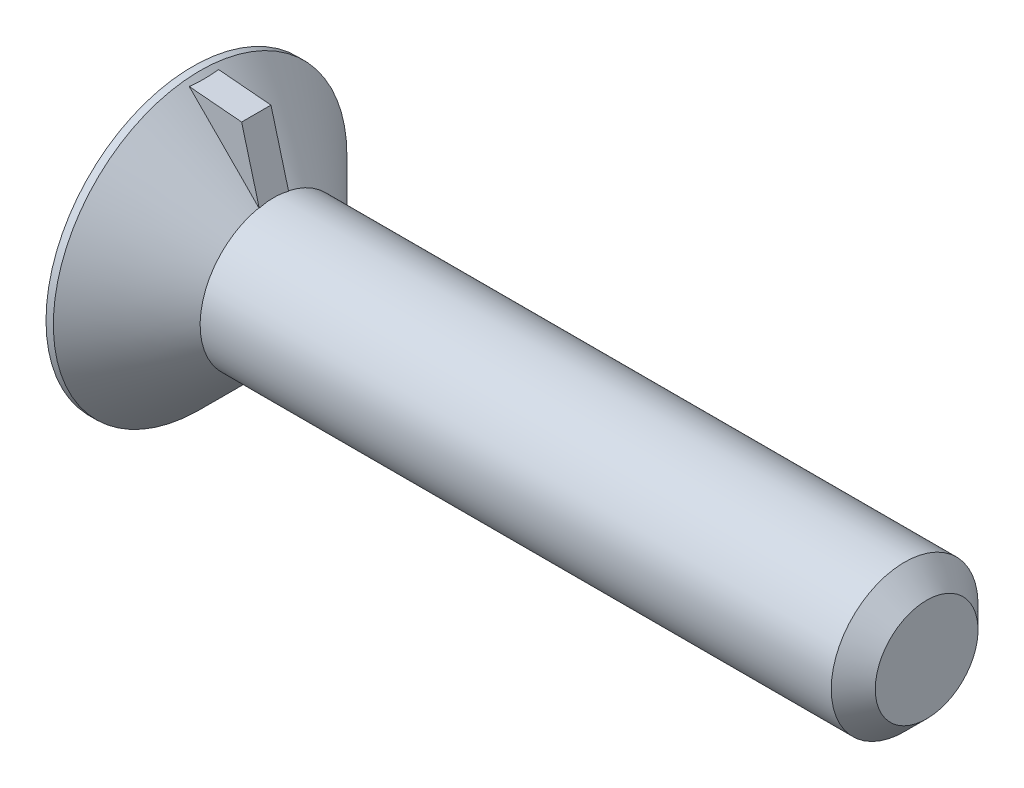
ISO-10303-21;
HEADER;
FILE_DESCRIPTION(('STEP AP214'),'2;1');
FILE_NAME('part.step','',(''),(''),'','','');
FILE_SCHEMA(('AUTOMOTIVE_DESIGN { 1 0 10303 214 1 1 1 1 }'));
ENDSEC;
DATA;
#1=APPLICATION_CONTEXT('core data for automotive mechanical design processes');
#2=APPLICATION_PROTOCOL_DEFINITION('international standard','automotive_design',2000,#1);
#3=PRODUCT_CONTEXT('',#1,'mechanical');
#4=PRODUCT('Part','Part','',(#3));
#5=PRODUCT_RELATED_PRODUCT_CATEGORY('part','',(#4));
#6=PRODUCT_DEFINITION_FORMATION('','',#4);
#7=PRODUCT_DEFINITION_CONTEXT('part definition',#1,'design');
#8=PRODUCT_DEFINITION('design','',#6,#7);
#9=PRODUCT_DEFINITION_SHAPE('','',#8);
#10=(LENGTH_UNIT() NAMED_UNIT(*) SI_UNIT(.MILLI.,.METRE.));
#11=(NAMED_UNIT(*) PLANE_ANGLE_UNIT() SI_UNIT($,.RADIAN.));
#12=(NAMED_UNIT(*) SI_UNIT($,.STERADIAN.) SOLID_ANGLE_UNIT());
#13=UNCERTAINTY_MEASURE_WITH_UNIT(LENGTH_MEASURE(1.E-05),#10,'distance_accuracy_value','');
#14=(GEOMETRIC_REPRESENTATION_CONTEXT(3) GLOBAL_UNCERTAINTY_ASSIGNED_CONTEXT((#13)) GLOBAL_UNIT_ASSIGNED_CONTEXT((#10,
#11,#12)) REPRESENTATION_CONTEXT('',''));
#15=CARTESIAN_POINT('',(0.,0.,0.));
#16=DIRECTION('',(0.,0.,1.));
#17=DIRECTION('',(1.,0.,0.));
#18=AXIS2_PLACEMENT_3D('',#15,#16,#17);
#19=CARTESIAN_POINT('',(50.,0.,0.));
#20=DIRECTION('',(1.,0.,0.));
#21=DIRECTION('',(0.,0.,-1.));
#22=AXIS2_PLACEMENT_3D('',#19,#20,#21);
#23=CYLINDRICAL_SURFACE('',#22,5.);
#24=DIRECTION('',(1.,0.,0.));
#25=VECTOR('',#24,1.);
#26=CARTESIAN_POINT('',(50.,4.89897948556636,1.));
#27=LINE('',#26,#25);
#28=CARTESIAN_POINT('',(5.5,4.89897948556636,1.));
#29=VERTEX_POINT('',#28);
#30=CARTESIAN_POINT('',(5.52706836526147,4.89897948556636,1.));
#31=VERTEX_POINT('',#30);
#32=EDGE_CURVE('E85',#29,#31,#27,.T.);
#33=ORIENTED_EDGE('',*,*,#32,.F.);
#34=CARTESIAN_POINT('',(5.5,0.,0.));
#35=DIRECTION('',(1.,0.,0.));
#36=DIRECTION('',(0.,0.,-1.));
#37=AXIS2_PLACEMENT_3D('',#34,#35,#36);
#38=CIRCLE('',#37,5.);
#39=CARTESIAN_POINT('',(5.5,4.89897948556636,-1.));
#40=VERTEX_POINT('',#39);
#41=EDGE_CURVE('E113',#29,#40,#38,.T.);
#42=ORIENTED_EDGE('',*,*,#41,.T.);
#43=DIRECTION('',(1.,0.,0.));
#44=VECTOR('',#43,1.);
#45=CARTESIAN_POINT('',(50.,4.89897948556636,-1.));
#46=LINE('',#45,#44);
#47=CARTESIAN_POINT('',(5.52706836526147,4.89897948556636,-1.));
#48=VERTEX_POINT('',#47);
#49=EDGE_CURVE('E55',#40,#48,#46,.T.);
#50=ORIENTED_EDGE('',*,*,#49,.T.);
#51=CARTESIAN_POINT('',(6.83974596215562,0.,0.));
#52=DIRECTION('',(-0.965925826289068,-0.258819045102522,0.));
#53=DIRECTION('',(0.258819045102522,-0.965925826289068,0.));
#54=AXIS2_PLACEMENT_3D('',#51,#52,#53);
#55=ELLIPSE('',#54,5.17638090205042,5.);
#56=EDGE_CURVE('E105',#48,#31,#55,.F.);
#57=ORIENTED_EDGE('',*,*,#56,.T.);
#58=EDGE_LOOP('',(#33,#42,#50,#57));
#59=FACE_BOUND('',#58,.T.);
#60=CARTESIAN_POINT('',(48.5,0.,0.));
#61=DIRECTION('',(-1.,0.,0.));
#62=DIRECTION('',(0.,0.,1.));
#63=AXIS2_PLACEMENT_3D('',#60,#61,#62);
#64=CIRCLE('',#63,5.);
#65=CARTESIAN_POINT('',(48.5,0.,5.));
#66=VERTEX_POINT('',#65);
#67=EDGE_CURVE('E110',#66,#66,#64,.T.);
#68=ORIENTED_EDGE('',*,*,#67,.T.);
#69=EDGE_LOOP('',(#68));
#70=FACE_BOUND('',#69,.T.);
#71=ADVANCED_FACE('F34',(#59,#70),#23,.T.);
#72=CARTESIAN_POINT('',(0.,0.,0.));
#73=DIRECTION('',(-1.,0.,0.));
#74=DIRECTION('',(0.,0.,1.));
#75=AXIS2_PLACEMENT_3D('',#72,#73,#74);
#76=PLANE('',#75);
#77=CARTESIAN_POINT('',(0.,0.,0.));
#78=DIRECTION('',(1.,0.,0.));
#79=DIRECTION('',(0.,0.,-1.));
#80=AXIS2_PLACEMENT_3D('',#77,#78,#79);
#81=CIRCLE('',#80,10.);
#82=CARTESIAN_POINT('',(0.,0.,-10.));
#83=VERTEX_POINT('',#82);
#84=EDGE_CURVE('E119',#83,#83,#81,.T.);
#85=ORIENTED_EDGE('',*,*,#84,.F.);
#86=EDGE_LOOP('',(#85));
#87=FACE_BOUND('',#86,.T.);
#88=ADVANCED_FACE('F36',(#87),#76,.T.);
#89=CARTESIAN_POINT('',(50.,0.,0.));
#90=DIRECTION('',(1.,0.,0.));
#91=DIRECTION('',(0.,0.,-1.));
#92=AXIS2_PLACEMENT_3D('',#89,#90,#91);
#93=CYLINDRICAL_SURFACE('',#92,10.);
#94=ORIENTED_EDGE('',*,*,#84,.T.);
#95=EDGE_LOOP('',(#94));
#96=FACE_BOUND('',#95,.T.);
#97=CARTESIAN_POINT('',(0.5,0.,0.));
#98=DIRECTION('',(1.,0.,0.));
#99=DIRECTION('',(0.,0.,-1.));
#100=AXIS2_PLACEMENT_3D('',#97,#98,#99);
#101=CIRCLE('',#100,10.);
#102=CARTESIAN_POINT('',(0.5,0.,-10.));
#103=VERTEX_POINT('',#102);
#104=EDGE_CURVE('E116',#103,#103,#101,.T.);
#105=ORIENTED_EDGE('',*,*,#104,.F.);
#106=EDGE_LOOP('',(#105));
#107=FACE_BOUND('',#106,.T.);
#108=ADVANCED_FACE('F157',(#96,#107),#93,.T.);
#109=CARTESIAN_POINT('',(5.5,0.,0.));
#110=DIRECTION('',(-1.,0.,0.));
#111=DIRECTION('',(0.,0.,1.));
#112=AXIS2_PLACEMENT_3D('',#109,#110,#111);
#113=CONICAL_SURFACE('',#112,5.,0.785398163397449);
#114=CARTESIAN_POINT('',(-5.86451778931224,16.3339353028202,1.));
#115=CARTESIAN_POINT('',(-5.30910830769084,15.7774780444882,1.));
#116=CARTESIAN_POINT('',(-4.75374445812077,15.2209752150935,1.));
#117=CARTESIAN_POINT('',(-3.64315689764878,14.1078128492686,1.));
#118=CARTESIAN_POINT('',(-3.08793318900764,13.5511533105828,1.));
#119=CARTESIAN_POINT('',(-1.97750348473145,12.437440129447,1.));
#120=CARTESIAN_POINT('',(-1.42229755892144,11.880386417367,1.));
#121=CARTESIAN_POINT('',(-0.312207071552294,10.7659753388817,1.));
#122=CARTESIAN_POINT('',(0.242677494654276,10.208617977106,1.));
#123=CARTESIAN_POINT('',(1.36957336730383,9.07569754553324,1.));
#124=CARTESIAN_POINT('',(1.94156874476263,8.50011862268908,1.));
#125=CARTESIAN_POINT('',(2.79885717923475,7.63602450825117,1.));
#126=CARTESIAN_POINT('',(3.08450916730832,7.34786549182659,1.));
#127=CARTESIAN_POINT('',(3.65546813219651,6.77120839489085,1.));
#128=CARTESIAN_POINT('',(3.94077511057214,6.48271031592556,1.));
#129=CARTESIAN_POINT('',(4.51082605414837,5.90528037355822,1.));
#130=CARTESIAN_POINT('',(4.79557012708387,5.61634861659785,1.));
#131=CARTESIAN_POINT('',(5.36427718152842,5.03770743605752,1.));
#132=CARTESIAN_POINT('',(5.64824014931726,4.7479979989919,1.));
#133=CARTESIAN_POINT('',(6.21484769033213,4.16733507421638,1.));
#134=CARTESIAN_POINT('',(6.49749236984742,3.87638169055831,1.));
#135=CARTESIAN_POINT('',(6.9195828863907,3.4381508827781,1.));
#136=CARTESIAN_POINT('',(7.05996503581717,3.29177587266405,1.));
#137=CARTESIAN_POINT('',(7.33980201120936,2.99814265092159,1.));
#138=CARTESIAN_POINT('',(7.47925684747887,2.85088444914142,1.));
#139=CARTESIAN_POINT('',(7.65533286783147,2.66314049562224,1.));
#140=CARTESIAN_POINT('',(7.69261956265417,2.62327880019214,1.));
#141=CARTESIAN_POINT('',(7.76707246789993,2.54344282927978,1.));
#142=CARTESIAN_POINT('',(7.80423867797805,2.50346855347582,1.));
#143=CARTESIAN_POINT('',(7.91553318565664,2.38335435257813,1.));
#144=CARTESIAN_POINT('',(7.98945636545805,2.30302411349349,1.));
#145=CARTESIAN_POINT('',(8.13636488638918,2.14193015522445,1.));
#146=CARTESIAN_POINT('',(8.2093523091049,2.06116833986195,1.));
#147=CARTESIAN_POINT('',(8.35432256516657,1.8987534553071,1.));
#148=CARTESIAN_POINT('',(8.42630543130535,1.81710041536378,1.));
#149=CARTESIAN_POINT('',(8.589561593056,1.62869147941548,1.));
#150=CARTESIAN_POINT('',(8.68037030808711,1.52152777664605,1.));
#151=CARTESIAN_POINT('',(8.8137992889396,1.35803214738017,1.));
#152=CARTESIAN_POINT('',(8.85792192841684,1.30292934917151,1.));
#153=CARTESIAN_POINT('',(8.94476202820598,1.19163070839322,1.));
#154=CARTESIAN_POINT('',(8.98747963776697,1.13543498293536,1.));
#155=CARTESIAN_POINT('',(9.07143814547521,1.02094273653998,1.));
#156=CARTESIAN_POINT('',(9.11265638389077,0.962629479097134,1.));
#157=CARTESIAN_POINT('',(9.19220927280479,0.843955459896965,1.));
#158=CARTESIAN_POINT('',(9.23054103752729,0.783592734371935,1.));
#159=CARTESIAN_POINT('',(9.3025037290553,0.660660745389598,1.));
#160=CARTESIAN_POINT('',(9.33616595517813,0.598110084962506,1.));
#161=CARTESIAN_POINT('',(9.396594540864,0.46977335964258,1.));
#162=CARTESIAN_POINT('',(9.42337704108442,0.40399530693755,1.));
#163=CARTESIAN_POINT('',(9.45545244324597,0.30341619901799,1.));
#164=CARTESIAN_POINT('',(9.46474391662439,0.269894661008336,1.));
#165=CARTESIAN_POINT('',(9.48030493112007,0.202147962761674,1.));
#166=CARTESIAN_POINT('',(9.48657494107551,0.167922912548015,1.));
#167=CARTESIAN_POINT('',(9.49566888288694,0.0991726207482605,1.));
#168=CARTESIAN_POINT('',(9.49850881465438,0.0646495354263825,1.));
#169=CARTESIAN_POINT('',(9.50058709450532,-0.00450653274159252,1.));
#170=CARTESIAN_POINT('',(9.49982554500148,-0.0391395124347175,1.));
#171=CARTESIAN_POINT('',(9.49476515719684,-0.108055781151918,1.));
#172=CARTESIAN_POINT('',(9.49047490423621,-0.142339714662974,1.));
#173=CARTESIAN_POINT('',(9.47866573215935,-0.210349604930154,1.));
#174=CARTESIAN_POINT('',(9.47114555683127,-0.2440753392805,1.));
#175=CARTESIAN_POINT('',(9.45326702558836,-0.310959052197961,1.));
#176=CARTESIAN_POINT('',(9.44289280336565,-0.34411272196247,1.));
#177=CARTESIAN_POINT('',(9.41980604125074,-0.409582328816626,1.));
#178=CARTESIAN_POINT('',(9.40709357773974,-0.441898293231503,1.));
#179=CARTESIAN_POINT('',(9.37487113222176,-0.517157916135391,1.));
#180=CARTESIAN_POINT('',(9.35455853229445,-0.559755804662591,1.));
#181=CARTESIAN_POINT('',(9.31132430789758,-0.643615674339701,1.));
#182=CARTESIAN_POINT('',(9.28840108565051,-0.684876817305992,1.));
#183=CARTESIAN_POINT('',(9.24056377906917,-0.766334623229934,1.));
#184=CARTESIAN_POINT('',(9.21564565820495,-0.806528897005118,1.));
#185=CARTESIAN_POINT('',(9.16432868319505,-0.885964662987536,1.));
#186=CARTESIAN_POINT('',(9.13792952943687,-0.925205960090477,1.));
#187=CARTESIAN_POINT('',(9.05669099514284,-1.04227535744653,1.));
#188=CARTESIAN_POINT('',(9.00013831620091,-1.11891280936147,1.));
#189=CARTESIAN_POINT('',(8.91327106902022,-1.23218500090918,1.));
#190=CARTESIAN_POINT('',(8.88399653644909,-1.26963644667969,1.));
#191=CARTESIAN_POINT('',(8.82487392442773,-1.34408382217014,1.));
#192=CARTESIAN_POINT('',(8.79502586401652,-1.38107976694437,1.));
#193=CARTESIAN_POINT('',(8.6943603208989,-1.50426961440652,1.));
#194=CARTESIAN_POINT('',(8.62250715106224,-1.58961566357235,1.));
#195=CARTESIAN_POINT('',(8.47716150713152,-1.75890409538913,1.));
#196=CARTESIAN_POINT('',(8.40366887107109,-1.84284633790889,1.));
#197=CARTESIAN_POINT('',(8.25553553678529,-2.00975101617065,1.));
#198=CARTESIAN_POINT('',(8.18089452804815,-2.09271317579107,1.));
#199=CARTESIAN_POINT('',(8.03080190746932,-2.25790184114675,1.));
#200=CARTESIAN_POINT('',(7.95535028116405,-2.34012833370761,1.));
#201=CARTESIAN_POINT('',(7.72792156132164,-2.58619103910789,1.));
#202=CARTESIAN_POINT('',(7.57505539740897,-2.74920469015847,1.));
#203=CARTESIAN_POINT('',(7.26796350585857,-3.07388866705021,1.));
#204=CARTESIAN_POINT('',(7.11373800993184,-3.23555921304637,1.));
#205=CARTESIAN_POINT('',(6.80515273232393,-3.55723905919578,1.));
#206=CARTESIAN_POINT('',(6.65079739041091,-3.71725262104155,1.));
#207=CARTESIAN_POINT('',(6.34147242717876,-4.03669751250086,1.));
#208=CARTESIAN_POINT('',(6.18650277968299,-4.19612881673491,1.));
#209=CARTESIAN_POINT('',(5.72111443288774,-4.67363761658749,1.));
#210=CARTESIAN_POINT('',(5.4100583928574,-4.99109379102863,1.));
#211=CARTESIAN_POINT('',(4.99447848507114,-5.41397516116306,1.));
#212=CARTESIAN_POINT('',(4.89036935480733,-5.51980908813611,1.));
#213=CARTESIAN_POINT('',(4.6820486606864,-5.73139662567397,1.));
#214=CARTESIAN_POINT('',(4.57783708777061,-5.83715022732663,1.));
#215=CARTESIAN_POINT('',(4.36915163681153,-6.04876920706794,1.));
#216=CARTESIAN_POINT('',(4.26467762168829,-6.1546344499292,1.));
#217=CARTESIAN_POINT('',(4.05567302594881,-6.36628834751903,1.));
#218=CARTESIAN_POINT('',(3.95114245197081,-6.47207700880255,1.));
#219=CARTESIAN_POINT('',(3.8465836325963,-6.57783774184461,1.));
#220=B_SPLINE_CURVE_WITH_KNOTS('',3,(#114,#115,#116,#117,#118,#119,#120,#121,#122,#123,#124,
#125,#126,#127,#128,#129,#130,#131,#132,#133,#134,#135,#136,#137,#138,#139,#140,#141,#142,#143,
#144,#145,#146,#147,#148,#149,#150,#151,#152,#153,#154,#155,#156,#157,#158,#159,#160,#161,#162,
#163,#164,#165,#166,#167,#168,#169,#170,#171,#172,#173,#174,#175,#176,#177,#178,#179,#180,#181,
#182,#183,#184,#185,#186,#187,#188,#189,#190,#191,#192,#193,#194,#195,#196,#197,#198,#199,#200,
#201,#202,#203,#204,#205,#206,#207,#208,#209,#210,#211,#212,#213,#214,#215,#216,#217,#218,#219),
.UNSPECIFIED.,.F.,.F.,(4,2,2,2,2,2,2,2,2,2,2,2,2,2,2,2,2,2,2,2,2,2,2,2,2,2,2,2,2,2,2,2,2,2,2,2,
2,2,2,2,2,2,2,2,2,2,2,2,2,2,2,2,4),(0.,2.35862660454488,4.71728909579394,7.07675125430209,
9.43617839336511,11.8705622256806,13.0878105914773,14.3050534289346,15.5220349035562,
16.7390376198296,17.9559404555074,18.5643749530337,19.1728026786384,19.3365500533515,
19.5002978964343,19.827797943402,20.1543587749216,20.4809089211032,20.9022319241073,
21.1139901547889,21.3257258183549,21.5398988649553,21.7542832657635,21.967152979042,
22.1795186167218,22.2837608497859,22.3879869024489,22.4917248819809,22.59545991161,
22.6989432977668,22.802466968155,22.9065782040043,23.0106860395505,23.1521370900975,
23.2936751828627,23.4355072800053,23.5773681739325,23.8629718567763,24.0055768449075,
24.1481771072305,24.4828365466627,24.8175291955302,25.1523139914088,25.4871047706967,
26.1575159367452,26.8278149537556,27.4947975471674,28.1618088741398,29.4951489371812,
29.9405205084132,30.3859358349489,30.8321425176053,31.2783049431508),.UNSPECIFIED.);
#221=CARTESIAN_POINT('',(0.758826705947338,9.68970882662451,1.));
#222=VERTEX_POINT('',#221);
#223=EDGE_CURVE('E12',#222,#29,#220,.T.);
#224=ORIENTED_EDGE('',*,*,#223,.F.);
#225=CARTESIAN_POINT('',(0.758804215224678,9.68971079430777,1.0002));
#226=CARTESIAN_POINT('',(0.777536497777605,9.68807193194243,0.83394347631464));
#227=CARTESIAN_POINT('',(0.791656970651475,9.68683655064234,0.667153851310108));
#228=CARTESIAN_POINT('',(0.810486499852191,9.68518918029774,0.333575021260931));
#229=CARTESIAN_POINT('',(0.815225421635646,9.68477457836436,0.166787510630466));
#230=CARTESIAN_POINT('',(0.815225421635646,9.68477457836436,-0.166787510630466));
#231=CARTESIAN_POINT('',(0.810486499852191,9.68518918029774,-0.333575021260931));
#232=CARTESIAN_POINT('',(0.791656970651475,9.68683655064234,-0.667153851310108));
#233=CARTESIAN_POINT('',(0.777536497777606,9.68807193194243,-0.83394347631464));
#234=CARTESIAN_POINT('',(0.758804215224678,9.68971079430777,-1.0002));
#235=B_SPLINE_CURVE_WITH_KNOTS('',3,(#225,#226,#227,#228,#229,#230,#231,#232,#233,#234),
.UNSPECIFIED.,.F.,.F.,(4,2,2,2,4),(0.,0.501899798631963,1.00219925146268,1.50249870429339,
2.00439850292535),.UNSPECIFIED.);
#236=CARTESIAN_POINT('',(0.758826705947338,9.68970882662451,-1.));
#237=VERTEX_POINT('',#236);
#238=EDGE_CURVE('E48',#222,#237,#235,.T.);
#239=ORIENTED_EDGE('',*,*,#238,.T.);
#240=CARTESIAN_POINT('',(-5.86451778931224,16.3339353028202,-1.));
#241=CARTESIAN_POINT('',(-5.30910830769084,15.7774780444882,-1.));
#242=CARTESIAN_POINT('',(-4.75374445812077,15.2209752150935,-1.));
#243=CARTESIAN_POINT('',(-3.64315689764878,14.1078128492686,-1.));
#244=CARTESIAN_POINT('',(-3.08793318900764,13.5511533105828,-1.));
#245=CARTESIAN_POINT('',(-1.97750348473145,12.437440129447,-1.));
#246=CARTESIAN_POINT('',(-1.42229755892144,11.880386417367,-1.));
#247=CARTESIAN_POINT('',(-0.312207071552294,10.7659753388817,-1.));
#248=CARTESIAN_POINT('',(0.242677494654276,10.208617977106,-1.));
#249=CARTESIAN_POINT('',(1.36957336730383,9.07569754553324,-1.));
#250=CARTESIAN_POINT('',(1.94156874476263,8.50011862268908,-1.));
#251=CARTESIAN_POINT('',(2.79885717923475,7.63602450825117,-1.));
#252=CARTESIAN_POINT('',(3.08450916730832,7.34786549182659,-1.));
#253=CARTESIAN_POINT('',(3.65546813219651,6.77120839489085,-1.));
#254=CARTESIAN_POINT('',(3.94077511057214,6.48271031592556,-1.));
#255=CARTESIAN_POINT('',(4.51082605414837,5.90528037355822,-1.));
#256=CARTESIAN_POINT('',(4.79557012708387,5.61634861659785,-1.));
#257=CARTESIAN_POINT('',(5.36427718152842,5.03770743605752,-1.));
#258=CARTESIAN_POINT('',(5.64824014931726,4.7479979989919,-1.));
#259=CARTESIAN_POINT('',(6.21484769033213,4.16733507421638,-1.));
#260=CARTESIAN_POINT('',(6.49749236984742,3.87638169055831,-1.));
#261=CARTESIAN_POINT('',(6.9195828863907,3.4381508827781,-1.));
#262=CARTESIAN_POINT('',(7.05996503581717,3.29177587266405,-1.));
#263=CARTESIAN_POINT('',(7.33980201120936,2.99814265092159,-1.));
#264=CARTESIAN_POINT('',(7.47925684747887,2.85088444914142,-1.));
#265=CARTESIAN_POINT('',(7.65533286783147,2.66314049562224,-1.));
#266=CARTESIAN_POINT('',(7.69261956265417,2.62327880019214,-1.));
#267=CARTESIAN_POINT('',(7.76707246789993,2.54344282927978,-1.));
#268=CARTESIAN_POINT('',(7.80423867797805,2.50346855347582,-1.));
#269=CARTESIAN_POINT('',(7.91553318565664,2.38335435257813,-1.));
#270=CARTESIAN_POINT('',(7.98945636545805,2.30302411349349,-1.));
#271=CARTESIAN_POINT('',(8.13636488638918,2.14193015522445,-1.));
#272=CARTESIAN_POINT('',(8.2093523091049,2.06116833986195,-1.));
#273=CARTESIAN_POINT('',(8.35432256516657,1.8987534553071,-1.));
#274=CARTESIAN_POINT('',(8.42630543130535,1.81710041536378,-1.));
#275=CARTESIAN_POINT('',(8.589561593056,1.62869147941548,-1.));
#276=CARTESIAN_POINT('',(8.68037030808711,1.52152777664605,-1.));
#277=CARTESIAN_POINT('',(8.8137992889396,1.35803214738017,-1.));
#278=CARTESIAN_POINT('',(8.85792192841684,1.30292934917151,-1.));
#279=CARTESIAN_POINT('',(8.94476202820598,1.19163070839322,-1.));
#280=CARTESIAN_POINT('',(8.98747963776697,1.13543498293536,-1.));
#281=CARTESIAN_POINT('',(9.07143814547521,1.02094273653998,-1.));
#282=CARTESIAN_POINT('',(9.11265638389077,0.962629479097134,-1.));
#283=CARTESIAN_POINT('',(9.19220927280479,0.843955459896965,-1.));
#284=CARTESIAN_POINT('',(9.23054103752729,0.783592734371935,-1.));
#285=CARTESIAN_POINT('',(9.3025037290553,0.660660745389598,-1.));
#286=CARTESIAN_POINT('',(9.33616595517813,0.598110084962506,-1.));
#287=CARTESIAN_POINT('',(9.396594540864,0.46977335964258,-1.));
#288=CARTESIAN_POINT('',(9.42337704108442,0.40399530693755,-1.));
#289=CARTESIAN_POINT('',(9.45545244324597,0.30341619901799,-1.));
#290=CARTESIAN_POINT('',(9.46474391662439,0.269894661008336,-1.));
#291=CARTESIAN_POINT('',(9.48030493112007,0.202147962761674,-1.));
#292=CARTESIAN_POINT('',(9.48657494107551,0.167922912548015,-1.));
#293=CARTESIAN_POINT('',(9.49566888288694,0.0991726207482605,-1.));
#294=CARTESIAN_POINT('',(9.49850881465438,0.0646495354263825,-1.));
#295=CARTESIAN_POINT('',(9.50058709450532,-0.00450653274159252,-1.));
#296=CARTESIAN_POINT('',(9.49982554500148,-0.0391395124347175,-1.));
#297=CARTESIAN_POINT('',(9.49476515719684,-0.108055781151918,-1.));
#298=CARTESIAN_POINT('',(9.49047490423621,-0.142339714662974,-1.));
#299=CARTESIAN_POINT('',(9.47866573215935,-0.210349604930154,-1.));
#300=CARTESIAN_POINT('',(9.47114555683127,-0.2440753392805,-1.));
#301=CARTESIAN_POINT('',(9.45326702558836,-0.310959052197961,-1.));
#302=CARTESIAN_POINT('',(9.44289280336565,-0.34411272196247,-1.));
#303=CARTESIAN_POINT('',(9.41980604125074,-0.409582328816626,-1.));
#304=CARTESIAN_POINT('',(9.40709357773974,-0.441898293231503,-1.));
#305=CARTESIAN_POINT('',(9.37487113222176,-0.517157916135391,-1.));
#306=CARTESIAN_POINT('',(9.35455853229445,-0.559755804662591,-1.));
#307=CARTESIAN_POINT('',(9.31132430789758,-0.643615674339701,-1.));
#308=CARTESIAN_POINT('',(9.28840108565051,-0.684876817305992,-1.));
#309=CARTESIAN_POINT('',(9.24056377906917,-0.766334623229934,-1.));
#310=CARTESIAN_POINT('',(9.21564565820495,-0.806528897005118,-1.));
#311=CARTESIAN_POINT('',(9.16432868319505,-0.885964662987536,-1.));
#312=CARTESIAN_POINT('',(9.13792952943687,-0.925205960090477,-1.));
#313=CARTESIAN_POINT('',(9.05669099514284,-1.04227535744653,-1.));
#314=CARTESIAN_POINT('',(9.00013831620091,-1.11891280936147,-1.));
#315=CARTESIAN_POINT('',(8.91327106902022,-1.23218500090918,-1.));
#316=CARTESIAN_POINT('',(8.88399653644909,-1.26963644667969,-1.));
#317=CARTESIAN_POINT('',(8.82487392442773,-1.34408382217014,-1.));
#318=CARTESIAN_POINT('',(8.79502586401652,-1.38107976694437,-1.));
#319=CARTESIAN_POINT('',(8.6943603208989,-1.50426961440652,-1.));
#320=CARTESIAN_POINT('',(8.62250715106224,-1.58961566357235,-1.));
#321=CARTESIAN_POINT('',(8.47716150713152,-1.75890409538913,-1.));
#322=CARTESIAN_POINT('',(8.40366887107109,-1.84284633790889,-1.));
#323=CARTESIAN_POINT('',(8.25553553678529,-2.00975101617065,-1.));
#324=CARTESIAN_POINT('',(8.18089452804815,-2.09271317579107,-1.));
#325=CARTESIAN_POINT('',(8.03080190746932,-2.25790184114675,-1.));
#326=CARTESIAN_POINT('',(7.95535028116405,-2.34012833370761,-1.));
#327=CARTESIAN_POINT('',(7.72792156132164,-2.58619103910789,-1.));
#328=CARTESIAN_POINT('',(7.57505539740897,-2.74920469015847,-1.));
#329=CARTESIAN_POINT('',(7.26796350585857,-3.07388866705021,-1.));
#330=CARTESIAN_POINT('',(7.11373800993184,-3.23555921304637,-1.));
#331=CARTESIAN_POINT('',(6.80515273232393,-3.55723905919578,-1.));
#332=CARTESIAN_POINT('',(6.65079739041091,-3.71725262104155,-1.));
#333=CARTESIAN_POINT('',(6.34147242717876,-4.03669751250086,-1.));
#334=CARTESIAN_POINT('',(6.18650277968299,-4.19612881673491,-1.));
#335=CARTESIAN_POINT('',(5.72111443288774,-4.67363761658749,-1.));
#336=CARTESIAN_POINT('',(5.4100583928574,-4.99109379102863,-1.));
#337=CARTESIAN_POINT('',(4.99447848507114,-5.41397516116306,-1.));
#338=CARTESIAN_POINT('',(4.89036935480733,-5.51980908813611,-1.));
#339=CARTESIAN_POINT('',(4.6820486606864,-5.73139662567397,-1.));
#340=CARTESIAN_POINT('',(4.57783708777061,-5.83715022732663,-1.));
#341=CARTESIAN_POINT('',(4.36915163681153,-6.04876920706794,-1.));
#342=CARTESIAN_POINT('',(4.26467762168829,-6.1546344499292,-1.));
#343=CARTESIAN_POINT('',(4.05567302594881,-6.36628834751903,-1.));
#344=CARTESIAN_POINT('',(3.95114245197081,-6.47207700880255,-1.));
#345=CARTESIAN_POINT('',(3.8465836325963,-6.57783774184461,-1.));
#346=B_SPLINE_CURVE_WITH_KNOTS('',3,(#240,#241,#242,#243,#244,#245,#246,#247,#248,#249,#250,
#251,#252,#253,#254,#255,#256,#257,#258,#259,#260,#261,#262,#263,#264,#265,#266,#267,#268,#269,
#270,#271,#272,#273,#274,#275,#276,#277,#278,#279,#280,#281,#282,#283,#284,#285,#286,#287,#288,
#289,#290,#291,#292,#293,#294,#295,#296,#297,#298,#299,#300,#301,#302,#303,#304,#305,#306,#307,
#308,#309,#310,#311,#312,#313,#314,#315,#316,#317,#318,#319,#320,#321,#322,#323,#324,#325,#326,
#327,#328,#329,#330,#331,#332,#333,#334,#335,#336,#337,#338,#339,#340,#341,#342,#343,#344,#345),
.UNSPECIFIED.,.F.,.F.,(4,2,2,2,2,2,2,2,2,2,2,2,2,2,2,2,2,2,2,2,2,2,2,2,2,2,2,2,2,2,2,2,2,2,2,2,
2,2,2,2,2,2,2,2,2,2,2,2,2,2,2,2,4),(0.,2.35862660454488,4.71728909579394,7.07675125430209,
9.43617839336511,11.8705622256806,13.0878105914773,14.3050534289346,15.5220349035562,
16.7390376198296,17.9559404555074,18.5643749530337,19.1728026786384,19.3365500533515,
19.5002978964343,19.827797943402,20.1543587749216,20.4809089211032,20.9022319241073,
21.1139901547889,21.3257258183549,21.5398988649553,21.7542832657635,21.967152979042,
22.1795186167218,22.2837608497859,22.3879869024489,22.4917248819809,22.59545991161,
22.6989432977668,22.802466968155,22.9065782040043,23.0106860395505,23.1521370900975,
23.2936751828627,23.4355072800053,23.5773681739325,23.8629718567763,24.0055768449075,
24.1481771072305,24.4828365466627,24.8175291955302,25.1523139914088,25.4871047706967,
26.1575159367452,26.8278149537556,27.4947975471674,28.1618088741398,29.4951489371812,
29.9405205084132,30.3859358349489,30.8321425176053,31.2783049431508),.UNSPECIFIED.);
#347=EDGE_CURVE('E122',#237,#40,#346,.T.);
#348=ORIENTED_EDGE('',*,*,#347,.T.);
#349=ORIENTED_EDGE('',*,*,#41,.F.);
#350=EDGE_LOOP('',(#224,#239,#348,#349));
#351=FACE_BOUND('',#350,.T.);
#352=ORIENTED_EDGE('',*,*,#104,.T.);
#353=EDGE_LOOP('',(#352));
#354=FACE_BOUND('',#353,.T.);
#355=ADVANCED_FACE('F133',(#351,#354),#113,.T.);
#356=CARTESIAN_POINT('',(48.5,0.,0.));
#357=DIRECTION('',(-1.,0.,0.));
#358=DIRECTION('',(0.,0.,1.));
#359=AXIS2_PLACEMENT_3D('',#356,#357,#358);
#360=CONICAL_SURFACE('',#359,5.,0.785398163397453);
#361=CARTESIAN_POINT('',(50.,0.,0.));
#362=DIRECTION('',(-1.,0.,0.));
#363=DIRECTION('',(0.,0.,1.));
#364=AXIS2_PLACEMENT_3D('',#361,#362,#363);
#365=CIRCLE('',#364,3.49999999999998);
#366=CARTESIAN_POINT('',(50.,0.,3.49999999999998));
#367=VERTEX_POINT('',#366);
#368=EDGE_CURVE('E107',#367,#367,#365,.T.);
#369=ORIENTED_EDGE('',*,*,#368,.T.);
#370=EDGE_LOOP('',(#369));
#371=FACE_BOUND('',#370,.T.);
#372=ORIENTED_EDGE('',*,*,#67,.F.);
#373=EDGE_LOOP('',(#372));
#374=FACE_BOUND('',#373,.T.);
#375=ADVANCED_FACE('F146',(#371,#374),#360,.T.);
#376=CARTESIAN_POINT('',(50.,5.,0.));
#377=DIRECTION('',(1.,0.,0.));
#378=DIRECTION('',(0.,0.,-1.));
#379=AXIS2_PLACEMENT_3D('',#376,#377,#378);
#380=PLANE('',#379);
#381=ORIENTED_EDGE('',*,*,#368,.F.);
#382=EDGE_LOOP('',(#381));
#383=FACE_BOUND('',#382,.T.);
#384=ADVANCED_FACE('F145',(#383),#380,.T.);
#385=CARTESIAN_POINT('',(4.32704430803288,9.37753023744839,1.));
#386=DIRECTION('',(-0.0871557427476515,-0.996194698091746,0.));
#387=DIRECTION('',(0.996194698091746,-0.0871557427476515,0.));
#388=AXIS2_PLACEMENT_3D('',#385,#386,#387);
#389=PLANE('',#388);
#390=ORIENTED_EDGE('',*,*,#238,.F.);
#391=DIRECTION('',(-0.996194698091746,0.0871557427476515,0.));
#392=VECTOR('',#391,1.);
#393=CARTESIAN_POINT('',(4.32704430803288,9.37753023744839,1.));
#394=LINE('',#393,#392);
#395=CARTESIAN_POINT('',(4.32704430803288,9.37753023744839,1.));
#396=VERTEX_POINT('',#395);
#397=EDGE_CURVE('E84',#396,#222,#394,.T.);
#398=ORIENTED_EDGE('',*,*,#397,.F.);
#399=DIRECTION('',(0.,0.,-1.));
#400=VECTOR('',#399,1.);
#401=CARTESIAN_POINT('',(4.32704430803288,9.37753023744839,1.));
#402=LINE('',#401,#400);
#403=CARTESIAN_POINT('',(4.32704430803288,9.37753023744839,-1.));
#404=VERTEX_POINT('',#403);
#405=EDGE_CURVE('E87',#396,#404,#402,.T.);
#406=ORIENTED_EDGE('',*,*,#405,.T.);
#407=DIRECTION('',(-0.996194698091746,0.0871557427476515,0.));
#408=VECTOR('',#407,1.);
#409=CARTESIAN_POINT('',(4.32704430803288,9.37753023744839,-1.));
#410=LINE('',#409,#408);
#411=EDGE_CURVE('E99',#404,#237,#410,.T.);
#412=ORIENTED_EDGE('',*,*,#411,.T.);
#413=EDGE_LOOP('',(#390,#398,#406,#412));
#414=FACE_BOUND('',#413,.T.);
#415=ADVANCED_FACE('F96',(#414),#389,.F.);
#416=CARTESIAN_POINT('',(6.83974596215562,0.,1.));
#417=DIRECTION('',(-0.965925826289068,-0.258819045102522,0.));
#418=DIRECTION('',(0.258819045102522,-0.965925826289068,0.));
#419=AXIS2_PLACEMENT_3D('',#416,#417,#418);
#420=PLANE('',#419);
#421=ORIENTED_EDGE('',*,*,#56,.F.);
#422=DIRECTION('',(-0.258819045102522,0.965925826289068,0.));
#423=VECTOR('',#422,1.);
#424=CARTESIAN_POINT('',(6.83974596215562,0.,-1.));
#425=LINE('',#424,#423);
#426=EDGE_CURVE('E91',#48,#404,#425,.T.);
#427=ORIENTED_EDGE('',*,*,#426,.T.);
#428=ORIENTED_EDGE('',*,*,#405,.F.);
#429=DIRECTION('',(-0.258819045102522,0.965925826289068,0.));
#430=VECTOR('',#429,1.);
#431=CARTESIAN_POINT('',(6.83974596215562,0.,1.));
#432=LINE('',#431,#430);
#433=EDGE_CURVE('E80',#31,#396,#432,.T.);
#434=ORIENTED_EDGE('',*,*,#433,.F.);
#435=EDGE_LOOP('',(#421,#427,#428,#434));
#436=FACE_BOUND('',#435,.T.);
#437=ADVANCED_FACE('F90',(#436),#420,.F.);
#438=CARTESIAN_POINT('',(0.,9.75609756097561,1.));
#439=DIRECTION('',(0.,0.,1.));
#440=DIRECTION('',(1.,0.,0.));
#441=AXIS2_PLACEMENT_3D('',#438,#439,#440);
#442=PLANE('',#441);
#443=ORIENTED_EDGE('',*,*,#223,.T.);
#444=ORIENTED_EDGE('',*,*,#32,.T.);
#445=ORIENTED_EDGE('',*,*,#433,.T.);
#446=ORIENTED_EDGE('',*,*,#397,.T.);
#447=EDGE_LOOP('',(#443,#444,#445,#446));
#448=FACE_BOUND('',#447,.T.);
#449=ADVANCED_FACE('F82',(#448),#442,.T.);
#450=CARTESIAN_POINT('',(0.,9.75609756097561,-1.));
#451=DIRECTION('',(0.,0.,1.));
#452=DIRECTION('',(1.,0.,0.));
#453=AXIS2_PLACEMENT_3D('',#450,#451,#452);
#454=PLANE('',#453);
#455=ORIENTED_EDGE('',*,*,#49,.F.);
#456=ORIENTED_EDGE('',*,*,#347,.F.);
#457=ORIENTED_EDGE('',*,*,#411,.F.);
#458=ORIENTED_EDGE('',*,*,#426,.F.);
#459=EDGE_LOOP('',(#455,#456,#457,#458));
#460=FACE_BOUND('',#459,.T.);
#461=ADVANCED_FACE('F136',(#460),#454,.F.);
#462=CLOSED_SHELL('',(#71,#88,#108,#355,#375,#384,#415,#437,#449,#461));
#463=MANIFOLD_SOLID_BREP('B2',#462);
#464=ADVANCED_BREP_SHAPE_REPRESENTATION('',(#18,#463),#14);
#465=SHAPE_DEFINITION_REPRESENTATION(#9,#464);
ENDSEC;
END-ISO-10303-21;
